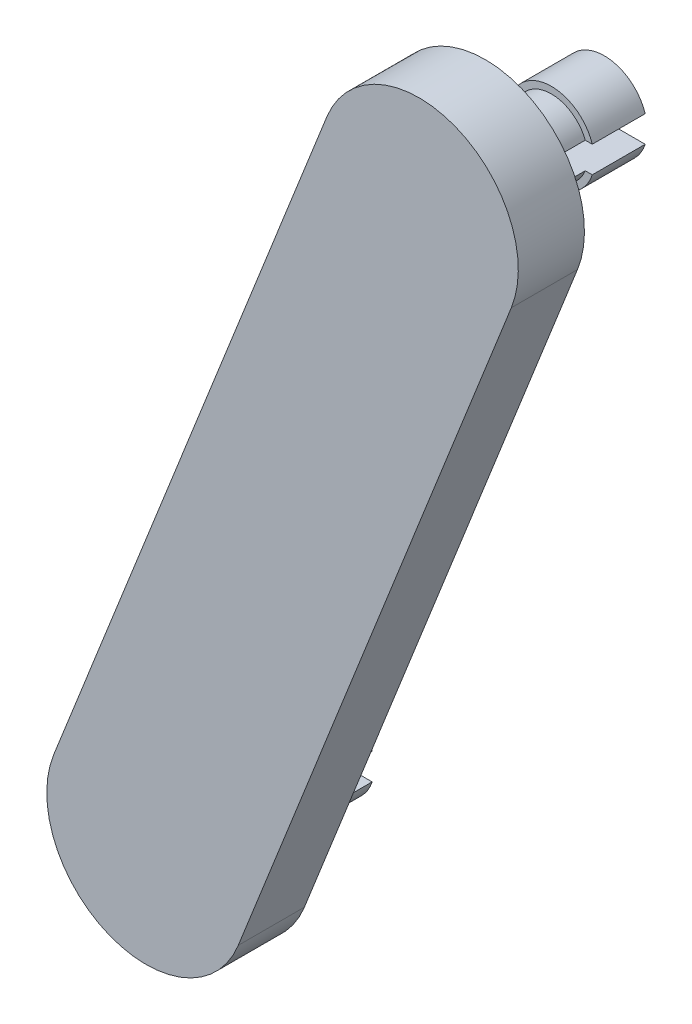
from build123d import *

# Parameters (mm, degrees)
BOSS_EXTRU_1_DEPTH      = 5
ESQUISSE3_R             = 2.75
BOSS_EXTRU_2_DEPTH      = 5
ESQUISSE4_R             = 3.25
BOSS_EXTRU_3_DEPTH      = 4
ESQUISSE5_W             = 10
ESQUISSE5_H             = 2
ENL_V_MAT_EXTRU_1_DEPTH = 9


with BuildPart() as part:
    # Esquisse1 → Boss.-Extru.1 (new body)
    with BuildSketch(Plane.XY):
        with BuildLine():
            Line((-145.281319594, -37.307724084), (-124.641872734, 14.750063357))
            ThreePointArc((-124.641872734, 14.750063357), (-114.905635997, 18.957876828), (-110.697822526, 9.221640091))
            Line((-110.697822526, 9.221640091), (-131.337269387, -42.83614735))
            ThreePointArc((-131.337269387, -42.83614735), (-141.073506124, -47.043960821), (-145.281319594, -37.307724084))
        make_face()
    extrude(amount=BOSS_EXTRU_1_DEPTH)

    # Esquisse3 → Boss.-Extru.2 (add)
    with BuildSketch(Plane.XY):
        with Locations((-117.66984763, 11.985851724)):
            Circle(ESQUISSE3_R)
        with Locations((-138.309294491, -40.071935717)):
            Circle(ESQUISSE3_R)
    extrude(amount=-BOSS_EXTRU_2_DEPTH)

    # Esquisse4 → Boss.-Extru.3 (add)
    with BuildSketch(Plane(origin=(0, 0, -5), x_dir=(-1, 0, 0), z_dir=(0, 0, -1))):
        with Locations((117.66984763, 11.985851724)):
            Circle(ESQUISSE4_R)
        with Locations((138.309294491, -40.071935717)):
            Circle(ESQUISSE4_R)
    extrude(amount=BOSS_EXTRU_3_DEPTH)

    # Esquisse5 → Enl_v. mat.-Extru.1 (cut)
    with BuildSketch(Plane(origin=(0, 0, -9), x_dir=(-1, 0, 0), z_dir=(0, 0, -1))):
        with Locations((138.309294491, -40.071935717)):
            Rectangle(ESQUISSE5_W, ESQUISSE5_H)
        with Locations((117.66984763, 11.985851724)):
            Rectangle(ESQUISSE5_W, ESQUISSE5_H)
    extrude(amount=-ENL_V_MAT_EXTRU_1_DEPTH, mode=Mode.SUBTRACT)


solid = part.part
